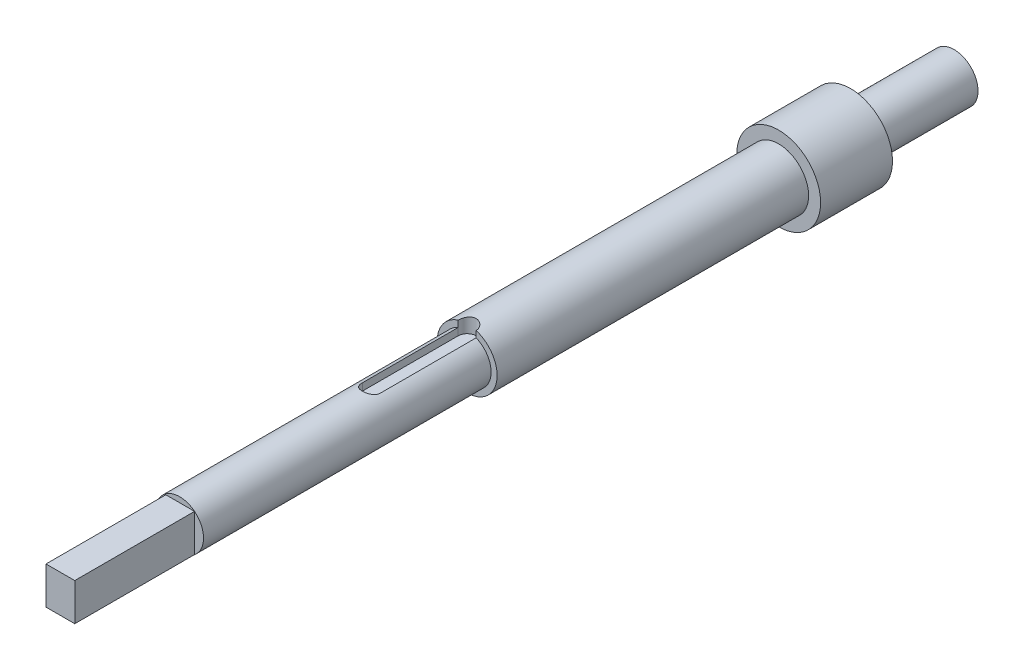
from build123d import *

# Parameters (mm, degrees)
SKETCH3_R               = 6.35
BOSS_EXTRUDE1_DEPTH     = 76.2
SKETCH5_R               = 7.9375
BOSS_EXTRUDE2_DEPTH     = 82.55
SKETCH6_R               = 11.1125
BOSS_EXTRUDE3_DEPTH     = 19.05
SKETCH9_W               = 7.62
SKETCH9_H               = 9.913934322
BOSS_EXTRUDE4_DEPTH     = 31.75
CUT_EXTRUDE1_DEPTH      = 110.916464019
CUT_EXTRUDE1_DEPTH_BACK = 2.38125
BOSS_EXTRUDE5_START     = 27.432
SKETCH10_R              = 6.35
BOSS_EXTRUDE5_DEPTH     = 27.432


with BuildPart() as part:
    # Sketch3 → Boss-Extrude1 (new body)
    with BuildSketch(Plane.XY):
        with Locations(Location((0, 0, 0), (0, 0, 180))):
            Circle(SKETCH3_R)
    extrude(amount=BOSS_EXTRUDE1_DEPTH)

    # Sketch5 → Boss-Extrude2 (add)
    with BuildSketch(Plane(origin=(0, 0, 0), x_dir=(-1, 0, 0), z_dir=(0, 0, -1))):
        Circle(SKETCH5_R)
    extrude(amount=BOSS_EXTRUDE2_DEPTH)

    # Sketch6 → Boss-Extrude3 (add)
    with BuildSketch(Plane(origin=(0, 0, -82.55), x_dir=(-1, 0, 0), z_dir=(0, 0, -1))):
        with Locations(Location((0, 0, 0), (0, 0, 180))):
            Circle(SKETCH6_R)
    extrude(amount=BOSS_EXTRUDE3_DEPTH)

    # Sketch9 → Boss-Extrude4 (add)
    with BuildSketch(Plane.XY.offset(76.2)):
        with Locations((0.15875, 0)):
            Rectangle(SKETCH9_W, SKETCH9_H)
    extrude(amount=BOSS_EXTRUDE4_DEPTH)

    # Sketch4 → Cut-Extrude1 (cut, two sides: drawn at the far end of the back side and taken through both)
    with BuildSketch(Plane(origin=(0, 6.35, 0), x_dir=(1, 0, 0), z_dir=(0, 1, 0)).offset(-CUT_EXTRUDE1_DEPTH_BACK)):
        with BuildLine():
            Line((2.38125, 0), (2.38125, -25.4))
            ThreePointArc((2.38125, -25.4), (0, -27.78125), (-2.38125, -25.4))
            Line((-2.38125, -25.4), (-2.38125, 0))
            ThreePointArc((-2.38125, 0), (0, 2.38125), (2.38125, 0))
        make_face()
    extrude(amount=CUT_EXTRUDE1_DEPTH + CUT_EXTRUDE1_DEPTH_BACK, mode=Mode.SUBTRACT)

    # Sketch10 → Boss-Extrude5 (add)
    with BuildSketch(Plane(origin=(0, 0, -101.6), x_dir=(-1, 0, 0), z_dir=(0, 0, -1)).offset(BOSS_EXTRUDE5_START)):
        with Locations(Location((0, 0, 0), (0, 0, 67.975687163))):
            Circle(SKETCH10_R)
    extrude(amount=-BOSS_EXTRUDE5_DEPTH)


solid = part.part
